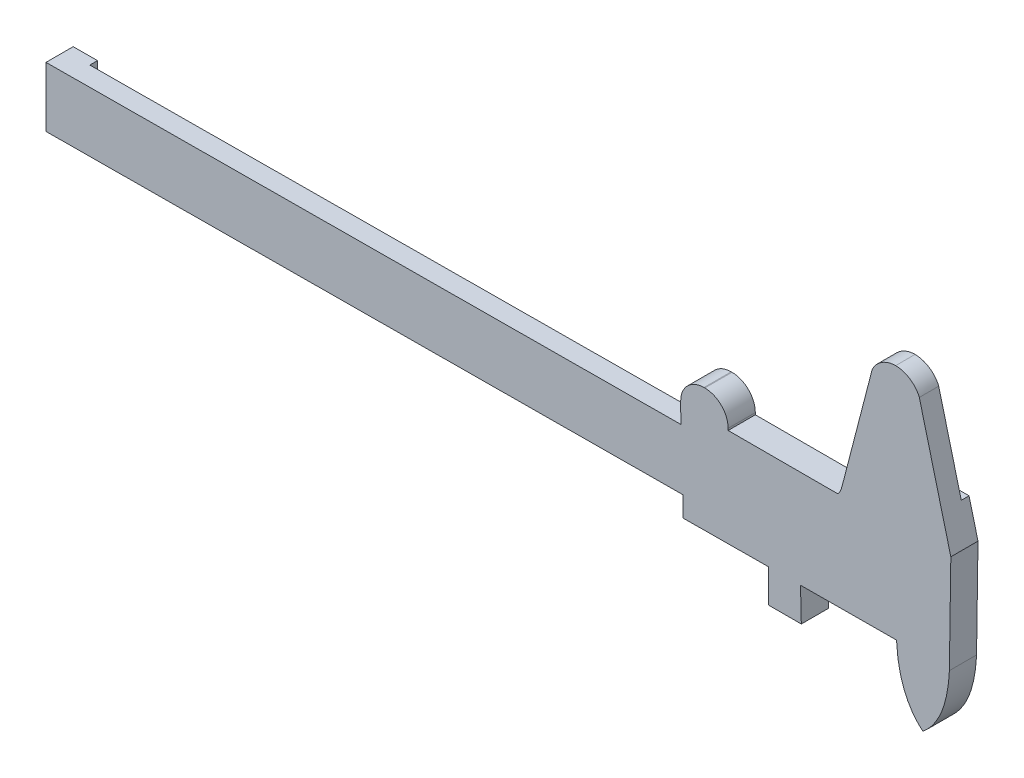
from build123d import *

# Parameters (mm, degrees)
BOSS_EXTRU_1_DEPTH      = 7
CONG_1_R                = 6
ENL_V_MAT_EXTRU_1_DEPTH = 2
ENL_V_MAT_EXTRU_2_DEPTH = 2


with BuildPart() as part:
    # Esquisse1 → Boss.-Extru.1 (new body)
    with BuildSketch(Plane.XY):
        with BuildLine():
            Line((228.639711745, 13.642527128), (203.90809172, 13.524147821))
            Line((203.90809172, 13.524147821), (204.11747669, 4.965537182))
            Line((204.11747669, 4.965537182), (195.684032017, 4.965537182))
            Line((195.684032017, 4.965537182), (195.626213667, 13.515576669))
            Line((195.626213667, 13.515576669), (173.639711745, 13.366896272))
            Line((173.639711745, 13.366896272), (173.639711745, 18.565858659))
            Line((173.639711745, 18.565858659), (9.537729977, 17.56482207))
            Line((9.537729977, 17.56482207), (9.537729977, 32.987005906))
            Line((9.537729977, 32.987005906), (173.074826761, 33.984596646))
            Line((173.074826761, 33.984596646), (173.006387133, 45.20404539))
            Line((173.006387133, 45.20404539), (185.266703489, 45.20404539))
            Line((185.266703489, 45.20404539), (185.266703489, 38.722869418))
            Line((185.266703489, 38.722869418), (213.478853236, 38.722869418))
            add(Edge.make_bspline(
                [(213.478853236, 38.722869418), (214.230563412, 39.405976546), (214.439289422, 40.267096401), (214.677418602, 41.185799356)],
                knots=[0, 0, 0, 0, 1, 1, 1, 1], degree=3))
            Line((214.677418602, 41.185799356), (222.335419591, 70.730385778))
            add(Edge.make_bspline(
                [(222.335419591, 70.730385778), (223.265458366, 73.106536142), (225.8347973, 74.774707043), (228.425269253, 74.774707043)],
                knots=[0, 0, 0, 0, 1, 1, 1, 1], degree=3))
            add(Edge.make_bspline(
                [(234.515118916, 70.730385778), (233.58508014, 73.106536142), (231.015741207, 74.774707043), (228.425269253, 74.774707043)],
                knots=[0, 0, 0, 0, 1, 1, 1, 1], degree=3))
            Line((234.515118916, 70.730385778), (242.634280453, 39.222027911))
            Line((242.634280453, 39.222027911), (242.259332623, 13.642527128))
            add(Edge.make_bspline(
                [(242.259332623, 13.642527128), (241.953725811, 7.500720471), (240.450788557, 0.84893052), (235.449522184, -3.306608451)],
                knots=[0, 0, 0, 0, 1, 1, 1, 1], degree=3))
            add(Edge.make_bspline(
                [(228.639711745, 13.642527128), (228.945318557, 7.500720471), (230.448255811, 0.84893052), (235.449522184, -3.306608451)],
                knots=[0, 0, 0, 0, 1, 1, 1, 1], degree=3))
        make_face()
    extrude(amount=BOSS_EXTRU_1_DEPTH)

    # Cong_1
    cong_1_edges = [part.edges().sort_by_distance(p)[0] for p in [
        (173.006387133, 45.20404539, 3.5),
        (185.266703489, 45.20404539, 3.5),
    ]]
    fillet(cong_1_edges, radius=CONG_1_R)

    # Esquisse2 → Enl_v. mat.-Extru.1 (cut)
    with BuildSketch(Plane(origin=(0, 0, 0), x_dir=(-1, 0, 0), z_dir=(0, 0, -1))):
        Polygon((-173.639711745, 18.565858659), (-173.074826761, 33.984596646), (-15.821208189, 33.025335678), (-15.821208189, 17.603151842), align=None)
    extrude(amount=-ENL_V_MAT_EXTRU_1_DEPTH, mode=Mode.SUBTRACT)

    # Esquisse3 → Enl_v. mat.-Extru.2 (cut)
    with BuildSketch(Plane(origin=(0, 0, 0), x_dir=(-1, 0, 0), z_dir=(0, 0, -1))):
        with BuildLine():
            Line((-222.335419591, 70.730385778), (-216.491232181, 48.18349655))
            Line((-216.491232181, 48.18349655), (-240.325064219, 48.18349655))
            Line((-240.325064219, 48.18349655), (-234.515118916, 70.730385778))
            add(Edge.make_bspline(
                [(-234.515118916, 70.730385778), (-233.58508014, 73.106536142), (-231.015741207, 74.774707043), (-228.425269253, 74.774707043)],
                knots=[0, 0, 0, 0, 1, 1, 1, 1], degree=3))
            add(Edge.make_bspline(
                [(-228.425269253, 74.774707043), (-225.8347973, 74.774707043), (-223.265458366, 73.106536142), (-222.335419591, 70.730385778)],
                knots=[0, 0, 0, 0, 1, 1, 1, 1], degree=3))
        make_face()
    extrude(amount=-ENL_V_MAT_EXTRU_2_DEPTH, mode=Mode.SUBTRACT)


solid = part.part
